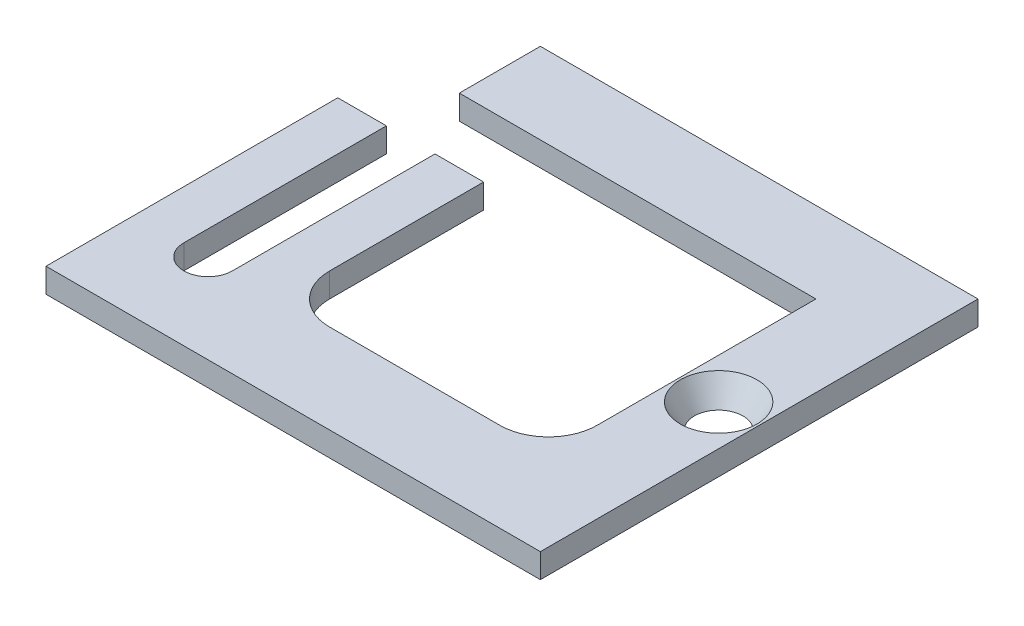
ISO-10303-21;
HEADER;
FILE_DESCRIPTION(('STEP AP214'),'2;1');
FILE_NAME('part.step','',(''),(''),'','','');
FILE_SCHEMA(('AUTOMOTIVE_DESIGN { 1 0 10303 214 1 1 1 1 }'));
ENDSEC;
DATA;
#1=APPLICATION_CONTEXT('core data for automotive mechanical design processes');
#2=APPLICATION_PROTOCOL_DEFINITION('international standard','automotive_design',2000,#1);
#3=PRODUCT_CONTEXT('',#1,'mechanical');
#4=PRODUCT('Part','Part','',(#3));
#5=PRODUCT_RELATED_PRODUCT_CATEGORY('part','',(#4));
#6=PRODUCT_DEFINITION_FORMATION('','',#4);
#7=PRODUCT_DEFINITION_CONTEXT('part definition',#1,'design');
#8=PRODUCT_DEFINITION('design','',#6,#7);
#9=PRODUCT_DEFINITION_SHAPE('','',#8);
#10=(LENGTH_UNIT() NAMED_UNIT(*) SI_UNIT(.MILLI.,.METRE.));
#11=(NAMED_UNIT(*) PLANE_ANGLE_UNIT() SI_UNIT($,.RADIAN.));
#12=(NAMED_UNIT(*) SI_UNIT($,.STERADIAN.) SOLID_ANGLE_UNIT());
#13=UNCERTAINTY_MEASURE_WITH_UNIT(LENGTH_MEASURE(1.E-05),#10,'distance_accuracy_value','');
#14=(GEOMETRIC_REPRESENTATION_CONTEXT(3) GLOBAL_UNCERTAINTY_ASSIGNED_CONTEXT((#13)) GLOBAL_UNIT_ASSIGNED_CONTEXT((#10,
#11,#12)) REPRESENTATION_CONTEXT('',''));
#15=CARTESIAN_POINT('',(0.,0.,0.));
#16=DIRECTION('',(0.,0.,1.));
#17=DIRECTION('',(1.,0.,0.));
#18=AXIS2_PLACEMENT_3D('',#15,#16,#17);
#19=CARTESIAN_POINT('',(9.,3.,-11.));
#20=DIRECTION('',(0.,1.,0.));
#21=DIRECTION('',(0.,0.,1.));
#22=AXIS2_PLACEMENT_3D('',#19,#20,#21);
#23=PLANE('',#22);
#24=DIRECTION('',(0.,0.,1.));
#25=VECTOR('',#24,1.);
#26=CARTESIAN_POINT('',(0.,3.,0.));
#27=LINE('',#26,#25);
#28=CARTESIAN_POINT('',(0.,3.,-36.));
#29=VERTEX_POINT('',#28);
#30=CARTESIAN_POINT('',(0.,3.,0.));
#31=VERTEX_POINT('',#30);
#32=EDGE_CURVE('E196',#29,#31,#27,.T.);
#33=ORIENTED_EDGE('',*,*,#32,.T.);
#34=DIRECTION('',(1.,0.,0.));
#35=VECTOR('',#34,1.);
#36=CARTESIAN_POINT('',(0.,3.,0.));
#37=LINE('',#36,#35);
#38=CARTESIAN_POINT('',(61.,3.,0.));
#39=VERTEX_POINT('',#38);
#40=EDGE_CURVE('E158',#31,#39,#37,.T.);
#41=ORIENTED_EDGE('',*,*,#40,.T.);
#42=DIRECTION('',(0.,0.,-1.));
#43=VECTOR('',#42,1.);
#44=CARTESIAN_POINT('',(61.,3.,0.));
#45=LINE('',#44,#43);
#46=CARTESIAN_POINT('',(61.,3.,-54.));
#47=VERTEX_POINT('',#46);
#48=EDGE_CURVE('E199',#39,#47,#45,.T.);
#49=ORIENTED_EDGE('',*,*,#48,.T.);
#50=DIRECTION('',(-1.,0.,0.));
#51=VECTOR('',#50,1.);
#52=CARTESIAN_POINT('',(7.,3.,-54.));
#53=LINE('',#52,#51);
#54=CARTESIAN_POINT('',(7.,3.,-54.));
#55=VERTEX_POINT('',#54);
#56=EDGE_CURVE('E201',#47,#55,#53,.T.);
#57=ORIENTED_EDGE('',*,*,#56,.T.);
#58=DIRECTION('',(0.,0.,1.));
#59=VECTOR('',#58,1.);
#60=CARTESIAN_POINT('',(7.,3.,-44.));
#61=LINE('',#60,#59);
#62=CARTESIAN_POINT('',(7.,3.,-44.));
#63=VERTEX_POINT('',#62);
#64=EDGE_CURVE('E203',#55,#63,#61,.T.);
#65=ORIENTED_EDGE('',*,*,#64,.T.);
#66=DIRECTION('',(1.,0.,0.));
#67=VECTOR('',#66,1.);
#68=CARTESIAN_POINT('',(7.,3.,-44.));
#69=LINE('',#68,#67);
#70=CARTESIAN_POINT('',(51.,3.,-44.));
#71=VERTEX_POINT('',#70);
#72=EDGE_CURVE('E205',#63,#71,#69,.T.);
#73=ORIENTED_EDGE('',*,*,#72,.T.);
#74=DIRECTION('',(0.,0.,1.));
#75=VECTOR('',#74,1.);
#76=CARTESIAN_POINT('',(51.,3.,-17.));
#77=LINE('',#76,#75);
#78=CARTESIAN_POINT('',(51.,3.,-17.));
#79=VERTEX_POINT('',#78);
#80=EDGE_CURVE('E207',#71,#79,#77,.T.);
#81=ORIENTED_EDGE('',*,*,#80,.T.);
#82=CARTESIAN_POINT('',(45.,3.,-17.));
#83=DIRECTION('',(0.,-1.,0.));
#84=DIRECTION('',(0.,0.,-1.));
#85=AXIS2_PLACEMENT_3D('',#82,#83,#84);
#86=CIRCLE('',#85,6.);
#87=CARTESIAN_POINT('',(45.,3.,-11.));
#88=VERTEX_POINT('',#87);
#89=EDGE_CURVE('E209',#79,#88,#86,.T.);
#90=ORIENTED_EDGE('',*,*,#89,.T.);
#91=DIRECTION('',(-1.,0.,0.));
#92=VECTOR('',#91,1.);
#93=CARTESIAN_POINT('',(24.,3.,-11.));
#94=LINE('',#93,#92);
#95=CARTESIAN_POINT('',(24.,3.,-11.));
#96=VERTEX_POINT('',#95);
#97=EDGE_CURVE('E211',#88,#96,#94,.T.);
#98=ORIENTED_EDGE('',*,*,#97,.T.);
#99=CARTESIAN_POINT('',(24.,3.,-17.));
#100=DIRECTION('',(0.,-1.,0.));
#101=DIRECTION('',(0.,0.,-1.));
#102=AXIS2_PLACEMENT_3D('',#99,#100,#101);
#103=CIRCLE('',#102,6.);
#104=CARTESIAN_POINT('',(18.,3.,-17.));
#105=VERTEX_POINT('',#104);
#106=EDGE_CURVE('E213',#96,#105,#103,.T.);
#107=ORIENTED_EDGE('',*,*,#106,.T.);
#108=DIRECTION('',(0.,0.,-1.));
#109=VECTOR('',#108,1.);
#110=CARTESIAN_POINT('',(18.,3.,-17.));
#111=LINE('',#110,#109);
#112=CARTESIAN_POINT('',(18.,3.,-36.));
#113=VERTEX_POINT('',#112);
#114=EDGE_CURVE('E215',#105,#113,#111,.T.);
#115=ORIENTED_EDGE('',*,*,#114,.T.);
#116=DIRECTION('',(-1.,0.,0.));
#117=VECTOR('',#116,1.);
#118=CARTESIAN_POINT('',(12.,3.,-36.));
#119=LINE('',#118,#117);
#120=CARTESIAN_POINT('',(12.,3.,-36.));
#121=VERTEX_POINT('',#120);
#122=EDGE_CURVE('E217',#113,#121,#119,.T.);
#123=ORIENTED_EDGE('',*,*,#122,.T.);
#124=DIRECTION('',(0.,0.,1.));
#125=VECTOR('',#124,1.);
#126=CARTESIAN_POINT('',(12.,3.,-11.));
#127=LINE('',#126,#125);
#128=CARTESIAN_POINT('',(12.,3.,-11.));
#129=VERTEX_POINT('',#128);
#130=EDGE_CURVE('E219',#121,#129,#127,.T.);
#131=ORIENTED_EDGE('',*,*,#130,.T.);
#132=CARTESIAN_POINT('',(9.,3.,-11.));
#133=DIRECTION('',(0.,-1.,0.));
#134=DIRECTION('',(0.,0.,1.));
#135=AXIS2_PLACEMENT_3D('',#132,#133,#134);
#136=CIRCLE('',#135,3.);
#137=CARTESIAN_POINT('',(6.,3.,-11.));
#138=VERTEX_POINT('',#137);
#139=EDGE_CURVE('E221',#129,#138,#136,.T.);
#140=ORIENTED_EDGE('',*,*,#139,.T.);
#141=DIRECTION('',(0.,0.,-1.));
#142=VECTOR('',#141,1.);
#143=CARTESIAN_POINT('',(6.,3.,-11.));
#144=LINE('',#143,#142);
#145=CARTESIAN_POINT('',(6.,3.,-36.));
#146=VERTEX_POINT('',#145);
#147=EDGE_CURVE('E51',#138,#146,#144,.T.);
#148=ORIENTED_EDGE('',*,*,#147,.T.);
#149=DIRECTION('',(-1.,0.,0.));
#150=VECTOR('',#149,1.);
#151=CARTESIAN_POINT('',(0.,3.,-36.));
#152=LINE('',#151,#150);
#153=EDGE_CURVE('E46',#146,#29,#152,.T.);
#154=ORIENTED_EDGE('',*,*,#153,.T.);
#155=EDGE_LOOP('',(#33,#41,#49,#57,#65,#73,#81,#90,#98,#107,#115,#123,#131,#140,#148,#154));
#156=FACE_BOUND('',#155,.T.);
#157=CARTESIAN_POINT('',(56.,3.,-27.));
#158=DIRECTION('',(0.,1.,0.));
#159=DIRECTION('',(0.,0.,1.));
#160=AXIS2_PLACEMENT_3D('',#157,#158,#159);
#161=CIRCLE('',#160,4.73205080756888);
#162=CARTESIAN_POINT('',(56.,3.,-22.2679491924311));
#163=VERTEX_POINT('',#162);
#164=EDGE_CURVE('E34',#163,#163,#161,.T.);
#165=ORIENTED_EDGE('',*,*,#164,.F.);
#166=EDGE_LOOP('',(#165));
#167=FACE_BOUND('',#166,.T.);
#168=ADVANCED_FACE('F30',(#156,#167),#23,.T.);
#169=CARTESIAN_POINT('',(9.,0.,-11.));
#170=DIRECTION('',(0.,1.,0.));
#171=DIRECTION('',(0.,0.,1.));
#172=AXIS2_PLACEMENT_3D('',#169,#170,#171);
#173=PLANE('',#172);
#174=DIRECTION('',(0.,0.,1.));
#175=VECTOR('',#174,1.);
#176=CARTESIAN_POINT('',(0.,0.,0.));
#177=LINE('',#176,#175);
#178=CARTESIAN_POINT('',(0.,0.,-36.));
#179=VERTEX_POINT('',#178);
#180=CARTESIAN_POINT('',(0.,0.,0.));
#181=VERTEX_POINT('',#180);
#182=EDGE_CURVE('E149',#179,#181,#177,.T.);
#183=ORIENTED_EDGE('',*,*,#182,.F.);
#184=DIRECTION('',(-1.,0.,0.));
#185=VECTOR('',#184,1.);
#186=CARTESIAN_POINT('',(0.,0.,-36.));
#187=LINE('',#186,#185);
#188=CARTESIAN_POINT('',(6.,0.,-36.));
#189=VERTEX_POINT('',#188);
#190=EDGE_CURVE('E194',#189,#179,#187,.T.);
#191=ORIENTED_EDGE('',*,*,#190,.F.);
#192=DIRECTION('',(0.,0.,-1.));
#193=VECTOR('',#192,1.);
#194=CARTESIAN_POINT('',(6.,0.,-11.));
#195=LINE('',#194,#193);
#196=CARTESIAN_POINT('',(6.,0.,-11.));
#197=VERTEX_POINT('',#196);
#198=EDGE_CURVE('E192',#197,#189,#195,.T.);
#199=ORIENTED_EDGE('',*,*,#198,.F.);
#200=CARTESIAN_POINT('',(9.,0.,-11.));
#201=DIRECTION('',(0.,-1.,0.));
#202=DIRECTION('',(0.,0.,1.));
#203=AXIS2_PLACEMENT_3D('',#200,#201,#202);
#204=CIRCLE('',#203,3.);
#205=CARTESIAN_POINT('',(12.,0.,-11.));
#206=VERTEX_POINT('',#205);
#207=EDGE_CURVE('E190',#206,#197,#204,.T.);
#208=ORIENTED_EDGE('',*,*,#207,.F.);
#209=DIRECTION('',(0.,0.,1.));
#210=VECTOR('',#209,1.);
#211=CARTESIAN_POINT('',(12.,0.,-11.));
#212=LINE('',#211,#210);
#213=CARTESIAN_POINT('',(12.,0.,-36.));
#214=VERTEX_POINT('',#213);
#215=EDGE_CURVE('E188',#214,#206,#212,.T.);
#216=ORIENTED_EDGE('',*,*,#215,.F.);
#217=DIRECTION('',(-1.,0.,0.));
#218=VECTOR('',#217,1.);
#219=CARTESIAN_POINT('',(12.,0.,-36.));
#220=LINE('',#219,#218);
#221=CARTESIAN_POINT('',(18.,0.,-36.));
#222=VERTEX_POINT('',#221);
#223=EDGE_CURVE('E186',#222,#214,#220,.T.);
#224=ORIENTED_EDGE('',*,*,#223,.F.);
#225=DIRECTION('',(0.,0.,-1.));
#226=VECTOR('',#225,1.);
#227=CARTESIAN_POINT('',(18.,0.,-17.));
#228=LINE('',#227,#226);
#229=CARTESIAN_POINT('',(18.,0.,-17.));
#230=VERTEX_POINT('',#229);
#231=EDGE_CURVE('E184',#230,#222,#228,.T.);
#232=ORIENTED_EDGE('',*,*,#231,.F.);
#233=CARTESIAN_POINT('',(24.,0.,-17.));
#234=DIRECTION('',(0.,-1.,0.));
#235=DIRECTION('',(0.,0.,-1.));
#236=AXIS2_PLACEMENT_3D('',#233,#234,#235);
#237=CIRCLE('',#236,6.);
#238=CARTESIAN_POINT('',(24.,0.,-11.));
#239=VERTEX_POINT('',#238);
#240=EDGE_CURVE('E182',#239,#230,#237,.T.);
#241=ORIENTED_EDGE('',*,*,#240,.F.);
#242=DIRECTION('',(-1.,0.,0.));
#243=VECTOR('',#242,1.);
#244=CARTESIAN_POINT('',(24.,0.,-11.));
#245=LINE('',#244,#243);
#246=CARTESIAN_POINT('',(45.,0.,-11.));
#247=VERTEX_POINT('',#246);
#248=EDGE_CURVE('E180',#247,#239,#245,.T.);
#249=ORIENTED_EDGE('',*,*,#248,.F.);
#250=CARTESIAN_POINT('',(45.,0.,-17.));
#251=DIRECTION('',(0.,-1.,0.));
#252=DIRECTION('',(0.,0.,-1.));
#253=AXIS2_PLACEMENT_3D('',#250,#251,#252);
#254=CIRCLE('',#253,6.);
#255=CARTESIAN_POINT('',(51.,0.,-17.));
#256=VERTEX_POINT('',#255);
#257=EDGE_CURVE('E178',#256,#247,#254,.T.);
#258=ORIENTED_EDGE('',*,*,#257,.F.);
#259=DIRECTION('',(0.,0.,1.));
#260=VECTOR('',#259,1.);
#261=CARTESIAN_POINT('',(51.,0.,-17.));
#262=LINE('',#261,#260);
#263=CARTESIAN_POINT('',(51.,0.,-44.));
#264=VERTEX_POINT('',#263);
#265=EDGE_CURVE('E176',#264,#256,#262,.T.);
#266=ORIENTED_EDGE('',*,*,#265,.F.);
#267=DIRECTION('',(1.,0.,0.));
#268=VECTOR('',#267,1.);
#269=CARTESIAN_POINT('',(7.,0.,-44.));
#270=LINE('',#269,#268);
#271=CARTESIAN_POINT('',(7.,0.,-44.));
#272=VERTEX_POINT('',#271);
#273=EDGE_CURVE('E174',#272,#264,#270,.T.);
#274=ORIENTED_EDGE('',*,*,#273,.F.);
#275=DIRECTION('',(0.,0.,1.));
#276=VECTOR('',#275,1.);
#277=CARTESIAN_POINT('',(7.,0.,-44.));
#278=LINE('',#277,#276);
#279=CARTESIAN_POINT('',(7.,0.,-54.));
#280=VERTEX_POINT('',#279);
#281=EDGE_CURVE('E172',#280,#272,#278,.T.);
#282=ORIENTED_EDGE('',*,*,#281,.F.);
#283=DIRECTION('',(-1.,0.,0.));
#284=VECTOR('',#283,1.);
#285=CARTESIAN_POINT('',(7.,0.,-54.));
#286=LINE('',#285,#284);
#287=CARTESIAN_POINT('',(61.,0.,-54.));
#288=VERTEX_POINT('',#287);
#289=EDGE_CURVE('E170',#288,#280,#286,.T.);
#290=ORIENTED_EDGE('',*,*,#289,.F.);
#291=DIRECTION('',(0.,0.,-1.));
#292=VECTOR('',#291,1.);
#293=CARTESIAN_POINT('',(61.,0.,0.));
#294=LINE('',#293,#292);
#295=CARTESIAN_POINT('',(61.,0.,0.));
#296=VERTEX_POINT('',#295);
#297=EDGE_CURVE('E151',#296,#288,#294,.T.);
#298=ORIENTED_EDGE('',*,*,#297,.F.);
#299=DIRECTION('',(1.,0.,0.));
#300=VECTOR('',#299,1.);
#301=CARTESIAN_POINT('',(0.,0.,0.));
#302=LINE('',#301,#300);
#303=EDGE_CURVE('E144',#181,#296,#302,.T.);
#304=ORIENTED_EDGE('',*,*,#303,.F.);
#305=EDGE_LOOP('',(#183,#191,#199,#208,#216,#224,#232,#241,#249,#258,#266,#274,#282,#290,#298,#304));
#306=FACE_BOUND('',#305,.T.);
#307=CARTESIAN_POINT('',(56.,0.,-27.));
#308=DIRECTION('',(0.,1.,0.));
#309=DIRECTION('',(0.,0.,1.));
#310=AXIS2_PLACEMENT_3D('',#307,#308,#309);
#311=CIRCLE('',#310,3.);
#312=CARTESIAN_POINT('',(56.,0.,-24.));
#313=VERTEX_POINT('',#312);
#314=EDGE_CURVE('E166',#313,#313,#311,.T.);
#315=ORIENTED_EDGE('',*,*,#314,.T.);
#316=EDGE_LOOP('',(#315));
#317=FACE_BOUND('',#316,.T.);
#318=ADVANCED_FACE('F145',(#306,#317),#173,.F.);
#319=CARTESIAN_POINT('',(0.,3.,0.));
#320=DIRECTION('',(1.,0.,0.));
#321=DIRECTION('',(0.,0.,-1.));
#322=AXIS2_PLACEMENT_3D('',#319,#320,#321);
#323=PLANE('',#322);
#324=ORIENTED_EDGE('',*,*,#182,.T.);
#325=DIRECTION('',(0.,-1.,0.));
#326=VECTOR('',#325,1.);
#327=CARTESIAN_POINT('',(0.,3.,0.));
#328=LINE('',#327,#326);
#329=EDGE_CURVE('E11',#31,#181,#328,.T.);
#330=ORIENTED_EDGE('',*,*,#329,.F.);
#331=ORIENTED_EDGE('',*,*,#32,.F.);
#332=DIRECTION('',(0.,-1.,0.));
#333=VECTOR('',#332,1.);
#334=CARTESIAN_POINT('',(0.,3.,-36.));
#335=LINE('',#334,#333);
#336=EDGE_CURVE('E163',#29,#179,#335,.T.);
#337=ORIENTED_EDGE('',*,*,#336,.T.);
#338=EDGE_LOOP('',(#324,#330,#331,#337));
#339=FACE_BOUND('',#338,.T.);
#340=ADVANCED_FACE('F162',(#339),#323,.F.);
#341=CARTESIAN_POINT('',(0.,3.,0.));
#342=DIRECTION('',(0.,0.,-1.));
#343=DIRECTION('',(-1.,0.,0.));
#344=AXIS2_PLACEMENT_3D('',#341,#342,#343);
#345=PLANE('',#344);
#346=ORIENTED_EDGE('',*,*,#303,.T.);
#347=DIRECTION('',(0.,-1.,0.));
#348=VECTOR('',#347,1.);
#349=CARTESIAN_POINT('',(61.,3.,0.));
#350=LINE('',#349,#348);
#351=EDGE_CURVE('E39',#39,#296,#350,.T.);
#352=ORIENTED_EDGE('',*,*,#351,.F.);
#353=ORIENTED_EDGE('',*,*,#40,.F.);
#354=ORIENTED_EDGE('',*,*,#329,.T.);
#355=EDGE_LOOP('',(#346,#352,#353,#354));
#356=FACE_BOUND('',#355,.T.);
#357=ADVANCED_FACE('F157',(#356),#345,.F.);
#358=CARTESIAN_POINT('',(61.,3.,0.));
#359=DIRECTION('',(-1.,0.,0.));
#360=DIRECTION('',(0.,0.,1.));
#361=AXIS2_PLACEMENT_3D('',#358,#359,#360);
#362=PLANE('',#361);
#363=ORIENTED_EDGE('',*,*,#297,.T.);
#364=DIRECTION('',(0.,-1.,0.));
#365=VECTOR('',#364,1.);
#366=CARTESIAN_POINT('',(61.,3.,-54.));
#367=LINE('',#366,#365);
#368=EDGE_CURVE('E262',#47,#288,#367,.T.);
#369=ORIENTED_EDGE('',*,*,#368,.F.);
#370=ORIENTED_EDGE('',*,*,#48,.F.);
#371=ORIENTED_EDGE('',*,*,#351,.T.);
#372=EDGE_LOOP('',(#363,#369,#370,#371));
#373=FACE_BOUND('',#372,.T.);
#374=ADVANCED_FACE('F267',(#373),#362,.F.);
#375=CARTESIAN_POINT('',(7.,3.,-54.));
#376=DIRECTION('',(0.,0.,1.));
#377=DIRECTION('',(1.,0.,0.));
#378=AXIS2_PLACEMENT_3D('',#375,#376,#377);
#379=PLANE('',#378);
#380=ORIENTED_EDGE('',*,*,#289,.T.);
#381=DIRECTION('',(0.,-1.,0.));
#382=VECTOR('',#381,1.);
#383=CARTESIAN_POINT('',(7.,3.,-54.));
#384=LINE('',#383,#382);
#385=EDGE_CURVE('E259',#55,#280,#384,.T.);
#386=ORIENTED_EDGE('',*,*,#385,.F.);
#387=ORIENTED_EDGE('',*,*,#56,.F.);
#388=ORIENTED_EDGE('',*,*,#368,.T.);
#389=EDGE_LOOP('',(#380,#386,#387,#388));
#390=FACE_BOUND('',#389,.T.);
#391=ADVANCED_FACE('F275',(#390),#379,.F.);
#392=CARTESIAN_POINT('',(7.,3.,-44.));
#393=DIRECTION('',(1.,0.,0.));
#394=DIRECTION('',(0.,0.,-1.));
#395=AXIS2_PLACEMENT_3D('',#392,#393,#394);
#396=PLANE('',#395);
#397=ORIENTED_EDGE('',*,*,#281,.T.);
#398=DIRECTION('',(0.,-1.,0.));
#399=VECTOR('',#398,1.);
#400=CARTESIAN_POINT('',(7.,3.,-44.));
#401=LINE('',#400,#399);
#402=EDGE_CURVE('E256',#63,#272,#401,.T.);
#403=ORIENTED_EDGE('',*,*,#402,.F.);
#404=ORIENTED_EDGE('',*,*,#64,.F.);
#405=ORIENTED_EDGE('',*,*,#385,.T.);
#406=EDGE_LOOP('',(#397,#403,#404,#405));
#407=FACE_BOUND('',#406,.T.);
#408=ADVANCED_FACE('F278',(#407),#396,.F.);
#409=CARTESIAN_POINT('',(7.,3.,-44.));
#410=DIRECTION('',(0.,0.,-1.));
#411=DIRECTION('',(-1.,0.,0.));
#412=AXIS2_PLACEMENT_3D('',#409,#410,#411);
#413=PLANE('',#412);
#414=ORIENTED_EDGE('',*,*,#273,.T.);
#415=DIRECTION('',(0.,-1.,0.));
#416=VECTOR('',#415,1.);
#417=CARTESIAN_POINT('',(51.,3.,-44.));
#418=LINE('',#417,#416);
#419=EDGE_CURVE('E253',#71,#264,#418,.T.);
#420=ORIENTED_EDGE('',*,*,#419,.F.);
#421=ORIENTED_EDGE('',*,*,#72,.F.);
#422=ORIENTED_EDGE('',*,*,#402,.T.);
#423=EDGE_LOOP('',(#414,#420,#421,#422));
#424=FACE_BOUND('',#423,.T.);
#425=ADVANCED_FACE('F283',(#424),#413,.F.);
#426=CARTESIAN_POINT('',(51.,3.,-17.));
#427=DIRECTION('',(1.,0.,0.));
#428=DIRECTION('',(0.,0.,-1.));
#429=AXIS2_PLACEMENT_3D('',#426,#427,#428);
#430=PLANE('',#429);
#431=ORIENTED_EDGE('',*,*,#265,.T.);
#432=DIRECTION('',(0.,-1.,0.));
#433=VECTOR('',#432,1.);
#434=CARTESIAN_POINT('',(51.,3.,-17.));
#435=LINE('',#434,#433);
#436=EDGE_CURVE('E250',#79,#256,#435,.T.);
#437=ORIENTED_EDGE('',*,*,#436,.F.);
#438=ORIENTED_EDGE('',*,*,#80,.F.);
#439=ORIENTED_EDGE('',*,*,#419,.T.);
#440=EDGE_LOOP('',(#431,#437,#438,#439));
#441=FACE_BOUND('',#440,.T.);
#442=ADVANCED_FACE('F289',(#441),#430,.F.);
#443=CARTESIAN_POINT('',(45.,3.,-17.));
#444=DIRECTION('',(0.,-1.,0.));
#445=DIRECTION('',(0.,0.,-1.));
#446=AXIS2_PLACEMENT_3D('',#443,#444,#445);
#447=CYLINDRICAL_SURFACE('',#446,6.);
#448=ORIENTED_EDGE('',*,*,#257,.T.);
#449=DIRECTION('',(0.,-1.,0.));
#450=VECTOR('',#449,1.);
#451=CARTESIAN_POINT('',(45.,3.,-11.));
#452=LINE('',#451,#450);
#453=EDGE_CURVE('E247',#88,#247,#452,.T.);
#454=ORIENTED_EDGE('',*,*,#453,.F.);
#455=ORIENTED_EDGE('',*,*,#89,.F.);
#456=ORIENTED_EDGE('',*,*,#436,.T.);
#457=EDGE_LOOP('',(#448,#454,#455,#456));
#458=FACE_BOUND('',#457,.T.);
#459=ADVANCED_FACE('F293',(#458),#447,.F.);
#460=CARTESIAN_POINT('',(24.,3.,-11.));
#461=DIRECTION('',(0.,0.,1.));
#462=DIRECTION('',(1.,0.,0.));
#463=AXIS2_PLACEMENT_3D('',#460,#461,#462);
#464=PLANE('',#463);
#465=ORIENTED_EDGE('',*,*,#248,.T.);
#466=DIRECTION('',(0.,-1.,0.));
#467=VECTOR('',#466,1.);
#468=CARTESIAN_POINT('',(24.,3.,-11.));
#469=LINE('',#468,#467);
#470=EDGE_CURVE('E244',#96,#239,#469,.T.);
#471=ORIENTED_EDGE('',*,*,#470,.F.);
#472=ORIENTED_EDGE('',*,*,#97,.F.);
#473=ORIENTED_EDGE('',*,*,#453,.T.);
#474=EDGE_LOOP('',(#465,#471,#472,#473));
#475=FACE_BOUND('',#474,.T.);
#476=ADVANCED_FACE('F298',(#475),#464,.F.);
#477=CARTESIAN_POINT('',(24.,3.,-17.));
#478=DIRECTION('',(0.,-1.,0.));
#479=DIRECTION('',(0.,0.,-1.));
#480=AXIS2_PLACEMENT_3D('',#477,#478,#479);
#481=CYLINDRICAL_SURFACE('',#480,6.);
#482=ORIENTED_EDGE('',*,*,#240,.T.);
#483=DIRECTION('',(0.,-1.,0.));
#484=VECTOR('',#483,1.);
#485=CARTESIAN_POINT('',(18.,3.,-17.));
#486=LINE('',#485,#484);
#487=EDGE_CURVE('E241',#105,#230,#486,.T.);
#488=ORIENTED_EDGE('',*,*,#487,.F.);
#489=ORIENTED_EDGE('',*,*,#106,.F.);
#490=ORIENTED_EDGE('',*,*,#470,.T.);
#491=EDGE_LOOP('',(#482,#488,#489,#490));
#492=FACE_BOUND('',#491,.T.);
#493=ADVANCED_FACE('F304',(#492),#481,.F.);
#494=CARTESIAN_POINT('',(18.,3.,-17.));
#495=DIRECTION('',(-1.,0.,0.));
#496=DIRECTION('',(0.,0.,1.));
#497=AXIS2_PLACEMENT_3D('',#494,#495,#496);
#498=PLANE('',#497);
#499=ORIENTED_EDGE('',*,*,#231,.T.);
#500=DIRECTION('',(0.,-1.,0.));
#501=VECTOR('',#500,1.);
#502=CARTESIAN_POINT('',(18.,3.,-36.));
#503=LINE('',#502,#501);
#504=EDGE_CURVE('E238',#113,#222,#503,.T.);
#505=ORIENTED_EDGE('',*,*,#504,.F.);
#506=ORIENTED_EDGE('',*,*,#114,.F.);
#507=ORIENTED_EDGE('',*,*,#487,.T.);
#508=EDGE_LOOP('',(#499,#505,#506,#507));
#509=FACE_BOUND('',#508,.T.);
#510=ADVANCED_FACE('F308',(#509),#498,.F.);
#511=CARTESIAN_POINT('',(12.,3.,-36.));
#512=DIRECTION('',(0.,0.,1.));
#513=DIRECTION('',(1.,0.,0.));
#514=AXIS2_PLACEMENT_3D('',#511,#512,#513);
#515=PLANE('',#514);
#516=ORIENTED_EDGE('',*,*,#223,.T.);
#517=DIRECTION('',(0.,-1.,0.));
#518=VECTOR('',#517,1.);
#519=CARTESIAN_POINT('',(12.,3.,-36.));
#520=LINE('',#519,#518);
#521=EDGE_CURVE('E235',#121,#214,#520,.T.);
#522=ORIENTED_EDGE('',*,*,#521,.F.);
#523=ORIENTED_EDGE('',*,*,#122,.F.);
#524=ORIENTED_EDGE('',*,*,#504,.T.);
#525=EDGE_LOOP('',(#516,#522,#523,#524));
#526=FACE_BOUND('',#525,.T.);
#527=ADVANCED_FACE('F313',(#526),#515,.F.);
#528=CARTESIAN_POINT('',(12.,3.,-11.));
#529=DIRECTION('',(1.,0.,0.));
#530=DIRECTION('',(0.,0.,-1.));
#531=AXIS2_PLACEMENT_3D('',#528,#529,#530);
#532=PLANE('',#531);
#533=ORIENTED_EDGE('',*,*,#215,.T.);
#534=DIRECTION('',(0.,-1.,0.));
#535=VECTOR('',#534,1.);
#536=CARTESIAN_POINT('',(12.,3.,-11.));
#537=LINE('',#536,#535);
#538=EDGE_CURVE('E232',#129,#206,#537,.T.);
#539=ORIENTED_EDGE('',*,*,#538,.F.);
#540=ORIENTED_EDGE('',*,*,#130,.F.);
#541=ORIENTED_EDGE('',*,*,#521,.T.);
#542=EDGE_LOOP('',(#533,#539,#540,#541));
#543=FACE_BOUND('',#542,.T.);
#544=ADVANCED_FACE('F319',(#543),#532,.F.);
#545=CARTESIAN_POINT('',(9.,3.,-11.));
#546=DIRECTION('',(0.,-1.,0.));
#547=DIRECTION('',(0.,0.,-1.));
#548=AXIS2_PLACEMENT_3D('',#545,#546,#547);
#549=CYLINDRICAL_SURFACE('',#548,3.);
#550=ORIENTED_EDGE('',*,*,#207,.T.);
#551=DIRECTION('',(0.,-1.,0.));
#552=VECTOR('',#551,1.);
#553=CARTESIAN_POINT('',(6.,3.,-11.));
#554=LINE('',#553,#552);
#555=EDGE_CURVE('E229',#138,#197,#554,.T.);
#556=ORIENTED_EDGE('',*,*,#555,.F.);
#557=ORIENTED_EDGE('',*,*,#139,.F.);
#558=ORIENTED_EDGE('',*,*,#538,.T.);
#559=EDGE_LOOP('',(#550,#556,#557,#558));
#560=FACE_BOUND('',#559,.T.);
#561=ADVANCED_FACE('F323',(#560),#549,.F.);
#562=CARTESIAN_POINT('',(6.,3.,-11.));
#563=DIRECTION('',(-1.,0.,0.));
#564=DIRECTION('',(0.,0.,1.));
#565=AXIS2_PLACEMENT_3D('',#562,#563,#564);
#566=PLANE('',#565);
#567=ORIENTED_EDGE('',*,*,#198,.T.);
#568=DIRECTION('',(0.,-1.,0.));
#569=VECTOR('',#568,1.);
#570=CARTESIAN_POINT('',(6.,3.,-36.));
#571=LINE('',#570,#569);
#572=EDGE_CURVE('E226',#146,#189,#571,.T.);
#573=ORIENTED_EDGE('',*,*,#572,.F.);
#574=ORIENTED_EDGE('',*,*,#147,.F.);
#575=ORIENTED_EDGE('',*,*,#555,.T.);
#576=EDGE_LOOP('',(#567,#573,#574,#575));
#577=FACE_BOUND('',#576,.T.);
#578=ADVANCED_FACE('F326',(#577),#566,.F.);
#579=CARTESIAN_POINT('',(0.,3.,-36.));
#580=DIRECTION('',(0.,0.,1.));
#581=DIRECTION('',(1.,0.,0.));
#582=AXIS2_PLACEMENT_3D('',#579,#580,#581);
#583=PLANE('',#582);
#584=ORIENTED_EDGE('',*,*,#190,.T.);
#585=ORIENTED_EDGE('',*,*,#336,.F.);
#586=ORIENTED_EDGE('',*,*,#153,.F.);
#587=ORIENTED_EDGE('',*,*,#572,.T.);
#588=EDGE_LOOP('',(#584,#585,#586,#587));
#589=FACE_BOUND('',#588,.T.);
#590=ADVANCED_FACE('F328',(#589),#583,.F.);
#591=CARTESIAN_POINT('',(56.,0.,-27.));
#592=DIRECTION('',(0.,1.,0.));
#593=DIRECTION('',(0.,0.,1.));
#594=AXIS2_PLACEMENT_3D('',#591,#592,#593);
#595=CONICAL_SURFACE('',#594,3.,0.5235987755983);
#596=ORIENTED_EDGE('',*,*,#164,.T.);
#597=EDGE_LOOP('',(#596));
#598=FACE_BOUND('',#597,.T.);
#599=ORIENTED_EDGE('',*,*,#314,.F.);
#600=EDGE_LOOP('',(#599));
#601=FACE_BOUND('',#600,.T.);
#602=ADVANCED_FACE('F32',(#598,#601),#595,.F.);
#603=CLOSED_SHELL('',(#168,#318,#340,#357,#374,#391,#408,#425,#442,#459,#476,#493,#510,#527,
#544,#561,#578,#590,#602));
#604=MANIFOLD_SOLID_BREP('B2',#603);
#605=ADVANCED_BREP_SHAPE_REPRESENTATION('',(#18,#604),#14);
#606=SHAPE_DEFINITION_REPRESENTATION(#9,#605);
ENDSEC;
END-ISO-10303-21;
